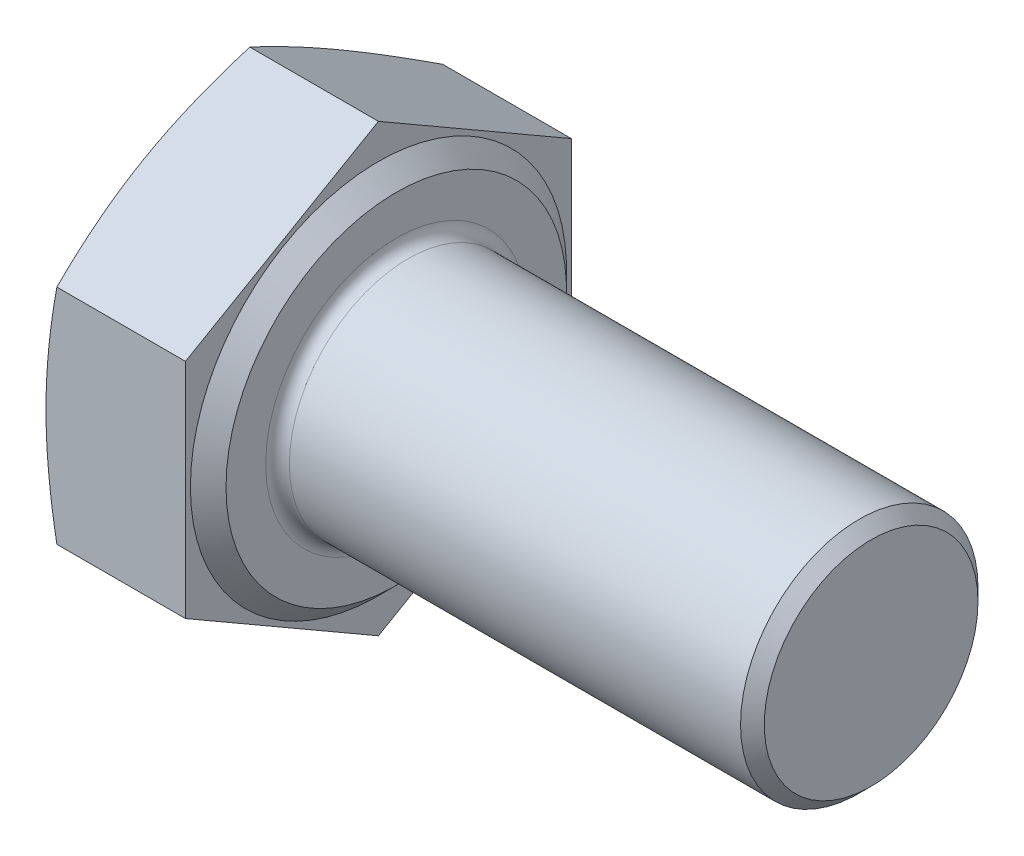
from build123d import *

# Parameters (mm, degrees)
BASEHEAD_DEPTH = 5.3
SKETCH5_R      = 4
BASEBODY_DEPTH = 16
CHAMFER1_SIZE  = 0.4
HEADFILLET_R   = 0.4


with BuildPart() as part:
    # Sketch2 → BaseHead (new body)
    with BuildSketch(Plane(origin=(0, 0, 0), x_dir=(0, 0, -1), z_dir=(1, 0, 0))):
        Polygon((0, -7.505553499), (6.5, -3.75277675), (6.5, 3.75277675), (0, 7.505553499), (-6.5, 3.75277675), (-6.5, -3.75277675), align=None)
    extrude(amount=BASEHEAD_DEPTH)

    # Sketch3 → BearingFace (revolve, cut)
    with BuildSketch(Plane.XY, mode=Mode.PRIVATE) as bearingface_sk:
        Polygon((5.3, 7.505553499), (5.3, 5.735), (4.7, 6.335), (4.7, 7.505553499), align=None)
    revolve(bearingface_sk.sketch.rotate(Axis((-0.957090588, 0, 0), (1, 0, 0)), 90), axis=Axis((-0.957090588, 0, 0), (1, 0, 0)), mode=Mode.SUBTRACT)

    # Sketch4 → HeadChamfer (revolve, cut)
    with BuildSketch(Plane.XY):
        Polygon((0, 7.505553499), (0.365991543, 7.505553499), (0, 6.5), align=None)
    revolve(axis=Axis((-0.493528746, 0, 0), (1, 0, 0)), mode=Mode.SUBTRACT)

    # Sketch5 → BaseBody (add)
    with BuildSketch(Plane(origin=(5.3, 0, 0), x_dir=(0, 0, -1), z_dir=(1, 0, 0))):
        Circle(SKETCH5_R)
    extrude(amount=BASEBODY_DEPTH)

    # Chamfer1
    chamfer1_edges = [part.edges().sort_by_distance(p)[0] for p in [
        (21.3, 0, 4),
    ]]
    chamfer(chamfer1_edges, length=CHAMFER1_SIZE)

    # HeadFillet
    headfillet_edges = [part.edges().sort_by_distance(p)[0] for p in [
        (5.3, 0, 4),
    ]]
    fillet(headfillet_edges, radius=HEADFILLET_R)


solid = part.part
